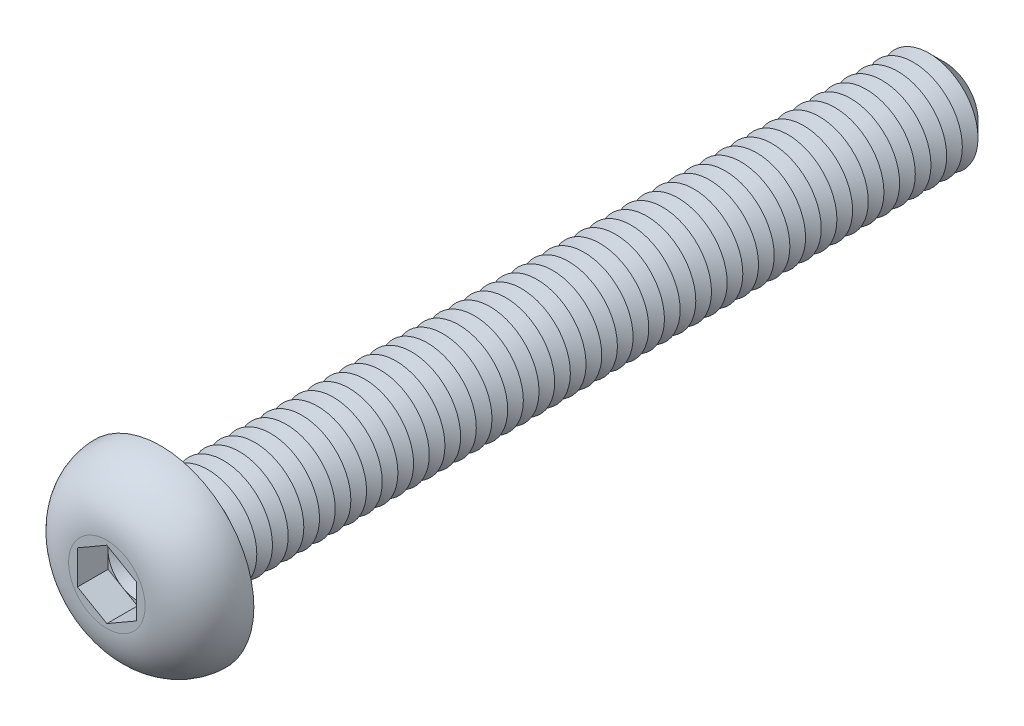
from build123d import *

# Parameters (mm, degrees)
CUT_EXTRUDE1_DEPTH  = 1.56
SKETCH4_R           = 2.5
BOSS_EXTRUDE1_DEPTH = 40
CHAMFER1_SIZE       = 0.8
LPATTERN1_COUNT     = 48
LPATTERN1_PITCH     = 0.8
FILLET2_R           = 0.4


with BuildPart() as part:
    # Sketch2 → Revolve1 (revolve)
    with BuildSketch(Plane(origin=(0, 0, 0), x_dir=(0, 0, -1), z_dir=(1, 0, 0)), mode=Mode.PRIVATE) as revolve1_sk:
        with BuildLine():
            Line((0, 0), (-2.75, 0))
            Line((-2.75, 0), (-2.75, 1.950446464))
            ThreePointArc((-2.75, 1.950446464), (-1.947498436, 3.912588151), (0, 4.75))
            Line((0, 4.75), (0, 0))
        make_face()
    revolve(revolve1_sk.sketch.rotate(Axis((0, 0, 47.934239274), (0, 0, -1)), 90), axis=Axis((0, 0, 47.934239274), (0, 0, -1)))

    # Sketch3 → Cut-Extrude1 (cut)
    with BuildSketch(Plane.XY.offset(2.75)):
        Polygon((0, 1.732050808), (-1.5, 0.866025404), (-1.5, -0.866025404), (0, -1.732050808), (1.5, -0.866025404), (1.5, 0.866025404), align=None)
    extrude(amount=-CUT_EXTRUDE1_DEPTH, mode=Mode.SUBTRACT)

    # Sketch4 → Boss-Extrude1 (add)
    with BuildSketch(Plane(origin=(0, 0, 0), x_dir=(-1, 0, 0), z_dir=(0, 0, -1))):
        with Locations(Location((0, 0, 0), (0, 0, 180))):
            Circle(SKETCH4_R)
    extrude(amount=BOSS_EXTRUDE1_DEPTH)

    # Chamfer1
    chamfer1_edges = [part.edges().sort_by_distance(p)[0] for p in [
        (-2.5, 0, -40),
    ]]
    chamfer(chamfer1_edges, length=CHAMFER1_SIZE)

    # Sketch5 → Cut-Revolve1 (revolve, cut)
    with BuildSketch(Plane(origin=(0, 0, 0), x_dir=(0, 0, -1), z_dir=(1, 0, 0)), mode=Mode.PRIVATE) as cut_revolve1_sk:
        Polygon((0.8, 2.5), (1.6, 2.5), (1.2, 1.807179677), align=None)
    cut_revolve1 = revolve(cut_revolve1_sk.sketch.rotate(Axis((0, 0, 47.934239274), (0, 0, -1)), 90), axis=Axis((0, 0, 47.934239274), (0, 0, -1)), mode=Mode.SUBTRACT)

    # LPattern1: Cut-Revolve1 ×48
    with Locations(*[(0, 0, -i * LPATTERN1_PITCH) for i in range(1, LPATTERN1_COUNT)]):
        add(cut_revolve1, mode=Mode.SUBTRACT)

    # Fillet2
    fillet2_edges = [part.edges().sort_by_distance(p)[0] for p in [
        (-2.5, 0, 0),
    ]]
    fillet(fillet2_edges, radius=FILLET2_R)

    # Cut-Extrude2 cone 1 section (on through the dimple's axis) → Cut-Extrude2 (revolve, cut)
    with BuildSketch(Plane(origin=(0, 0, 1.19), x_dir=(0, -1, 0), z_dir=(1, 0, 0))):
        Polygon((0, 0), (1.5, 0), (0, 0.866025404), align=None)
    revolve(axis=Axis((0, 0, 1.19), (0, 0, -1)), mode=Mode.SUBTRACT)


solid = part.part
